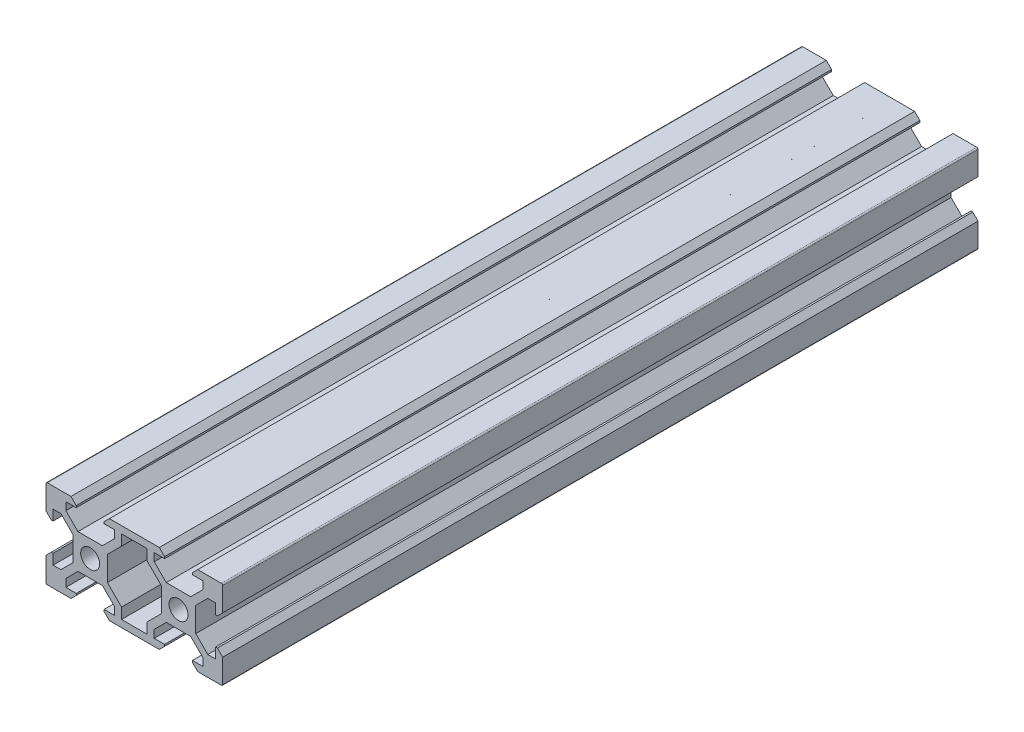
from build123d import *
from build123d.topology import SkipClean

# Parameters (mm, degrees)
SKETCH1_R           = 2.15
BOSS_EXTRUDE1_DEPTH = 41
BOSS_EXTRUDE2_START = 130
SKETCH2_R           = 2.15
BOSS_EXTRUDE2_DEPTH = 130


with BuildPart() as part:
    # Sketch1 → Boss-Extrude1 (new body)
    with BuildSketch(Plane.XY):
        with BuildLine():
            Line((131.660849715, 175.88977764), (129.310849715, 175.88977764))
            Line((129.310849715, 175.88977764), (129.310849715, 175.48977764))
            Line((129.310849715, 175.48977764), (130.510849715, 174.28977764))
            Line((130.510849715, 174.28977764), (141.810849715, 174.28977764))
            Line((141.810849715, 174.28977764), (143.010849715, 175.48977764))
            Line((143.010849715, 175.48977764), (143.010849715, 175.88977764))
            Line((143.010849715, 175.88977764), (140.660849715, 175.88977764))
            Line((140.660849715, 175.88977764), (140.660849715, 177.657206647))
            Line((140.660849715, 177.657206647), (143.393420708, 180.38977764))
            Line((143.393420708, 180.38977764), (148.928278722, 180.38977764))
            Line((148.928278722, 180.38977764), (151.660849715, 177.657206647))
            Line((151.660849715, 177.657206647), (151.660849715, 175.88977764))
            Line((151.660849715, 175.88977764), (149.310849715, 175.88977764))
            Line((149.310849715, 175.88977764), (149.310849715, 175.48977764))
            Line((149.310849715, 175.48977764), (150.510849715, 174.28977764))
            Line((150.510849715, 174.28977764), (155.860849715, 174.28977764))
            ThreePointArc((155.860849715, 174.28977764), (156.072981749, 174.377645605), (156.160849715, 174.58977764))
            Line((156.160849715, 174.58977764), (156.160849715, 179.93977764))
            Line((156.160849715, 179.93977764), (154.960849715, 181.13977764))
            Line((154.960849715, 181.13977764), (154.560849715, 181.13977764))
            Line((154.560849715, 181.13977764), (154.560849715, 178.78977764))
            Line((154.560849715, 178.78977764), (152.79324963, 178.78977764))
            Line((152.79324963, 178.78977764), (150.059649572, 181.522729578))
            Line((150.059649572, 181.522729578), (150.059649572, 187.056006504))
            Line((150.059649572, 187.056006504), (152.793420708, 189.78977764))
            Line((152.793420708, 189.78977764), (154.560849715, 189.78977764))
            Line((154.560849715, 189.78977764), (154.560849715, 187.43977764))
            Line((154.560849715, 187.43977764), (154.960849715, 187.43977764))
            Line((154.960849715, 187.43977764), (156.160849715, 188.63977764))
            Line((156.160849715, 188.63977764), (156.160849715, 193.98977764))
            ThreePointArc((156.160849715, 193.98977764), (156.072981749, 194.201909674), (155.860849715, 194.28977764))
            Line((155.860849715, 194.28977764), (150.510849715, 194.28977764))
            Line((150.510849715, 194.28977764), (149.310849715, 193.08977764))
            Line((149.310849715, 193.08977764), (149.310849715, 192.68977764))
            Line((149.310849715, 192.68977764), (151.660849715, 192.68977764))
            Line((151.660849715, 192.68977764), (151.660849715, 190.928228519))
            Line((151.660849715, 190.928228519), (148.924110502, 188.18977764))
            Line((148.924110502, 188.18977764), (143.391020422, 188.18977764))
            Line((143.391020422, 188.18977764), (140.660849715, 190.919301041))
            Line((140.660849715, 190.919301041), (140.660849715, 192.68977764))
            Line((140.660849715, 192.68977764), (143.010849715, 192.68977764))
            Line((143.010849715, 192.68977764), (143.010849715, 193.08977764))
            Line((143.010849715, 193.08977764), (141.810849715, 194.28977764))
            Line((141.810849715, 194.28977764), (130.510849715, 194.28977764))
            Line((130.510849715, 194.28977764), (129.310849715, 193.08977764))
            Line((129.310849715, 193.08977764), (129.310849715, 192.68977764))
            Line((129.310849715, 192.68977764), (131.660849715, 192.68977764))
            Line((131.660849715, 192.68977764), (131.660849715, 190.922348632))
            Line((131.660849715, 190.922348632), (128.928461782, 188.1899607))
            Line((128.928461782, 188.1899607), (123.393237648, 188.1899607))
            Line((123.393237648, 188.1899607), (120.660849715, 190.922348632))
            Line((120.660849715, 190.922348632), (120.660849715, 192.68977764))
            Line((120.660849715, 192.68977764), (123.010849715, 192.68977764))
            Line((123.010849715, 192.68977764), (123.010849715, 193.08977764))
            Line((123.010849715, 193.08977764), (121.810849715, 194.28977764))
            Line((121.810849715, 194.28977764), (116.46204982, 194.28977764))
            ThreePointArc((116.46204982, 194.28977764), (116.249917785, 194.201909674), (116.16204982, 193.98977764))
            Line((116.16204982, 193.98977764), (116.16204982, 188.63977764))
            Line((116.16204982, 188.63977764), (117.36204982, 187.43977764))
            Line((117.36204982, 187.43977764), (117.76204982, 187.43977764))
            Line((117.76204982, 187.43977764), (117.76204982, 189.78977764))
            Line((117.76204982, 189.78977764), (119.531155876, 189.78977764))
            Line((119.531155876, 189.78977764), (122.260849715, 187.060373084))
            Line((122.260849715, 187.060373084), (122.260849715, 181.522348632))
            Line((122.260849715, 181.522348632), (119.528278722, 178.78977764))
            Line((119.528278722, 178.78977764), (117.76204982, 178.78977764))
            Line((117.76204982, 178.78977764), (117.76204982, 181.13977764))
            Line((117.76204982, 181.13977764), (117.36204982, 181.13977764))
            Line((117.36204982, 181.13977764), (116.16204982, 179.93977764))
            Line((116.16204982, 179.93977764), (116.16204982, 174.58977764))
            ThreePointArc((116.16204982, 174.58977764), (116.249917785, 174.377645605), (116.46204982, 174.28977764))
            Line((116.46204982, 174.28977764), (121.810849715, 174.28977764))
            Line((121.810849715, 174.28977764), (123.010849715, 175.48977764))
            Line((123.010849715, 175.48977764), (123.010849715, 175.88977764))
            Line((123.010849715, 175.88977764), (120.660849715, 175.88977764))
            Line((120.660849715, 175.88977764), (120.660849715, 177.657854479))
            Line((120.660849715, 177.657854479), (123.392430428, 180.3899607))
            Line((123.392430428, 180.3899607), (128.93196908, 180.3899607))
            Line((128.93196908, 180.3899607), (131.660849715, 177.661369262))
            Line((131.660849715, 177.661369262), (131.660849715, 175.88977764))
        make_face()
        with Locations((146.160849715, 184.28977764)):
            Circle(SKETCH1_R, mode=Mode.SUBTRACT)
        with Locations((126.164133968, 184.2899607)):
            Circle(SKETCH1_R, mode=Mode.SUBTRACT)
        Polygon((142.259649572, 181.52114849), (142.259649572, 187.05840679), (139.060849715, 190.257206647), (139.060849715, 192.68977764), (133.260849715, 192.68977764), (133.260849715, 190.260278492), (130.060849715, 187.05966287), (130.060849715, 181.522348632), (133.260849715, 178.322348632), (133.260849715, 175.88977764), (139.060849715, 175.88977764), (139.060849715, 178.322348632), align=None, mode=Mode.SUBTRACT)
    extrude(amount=BOSS_EXTRUDE1_DEPTH)

    # Sketch2 → Boss-Extrude2 (add)
    with SkipClean():  # the faces are left unmerged after this step: merging them gives an invalid solid
        with BuildSketch(Plane(origin=(0, 0, 0), x_dir=(-1, 0, 0), z_dir=(0, 0, -1)).offset(BOSS_EXTRUDE2_START)):
            with BuildLine():
                Line((-129.310849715, 175.48977764), (-129.310849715, 175.88977764))
                Line((-129.310849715, 175.88977764), (-131.660849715, 175.88977764))
                Line((-131.660849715, 175.88977764), (-131.660849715, 177.661369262))
                Line((-131.660849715, 177.661369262), (-128.93196908, 180.3899607))
                Line((-128.93196908, 180.3899607), (-123.392430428, 180.3899607))
                Line((-123.392430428, 180.3899607), (-120.660849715, 177.657854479))
                Line((-120.660849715, 177.657854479), (-120.660849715, 175.88977764))
                Line((-120.660849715, 175.88977764), (-123.010849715, 175.88977764))
                Line((-123.010849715, 175.88977764), (-123.010849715, 175.48977764))
                Line((-123.010849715, 175.48977764), (-121.810849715, 174.28977764))
                Line((-121.810849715, 174.28977764), (-116.46204982, 174.28977764))
                ThreePointArc((-116.46204982, 174.28977764), (-116.249917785, 174.377645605), (-116.16204982, 174.58977764))
                Line((-116.16204982, 174.58977764), (-116.16204982, 179.93977764))
                Line((-116.16204982, 179.93977764), (-117.36204982, 181.13977764))
                Line((-117.36204982, 181.13977764), (-117.76204982, 181.13977764))
                Line((-117.76204982, 181.13977764), (-117.76204982, 178.78977764))
                Line((-117.76204982, 178.78977764), (-119.528278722, 178.78977764))
                Line((-119.528278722, 178.78977764), (-122.260849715, 181.522348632))
                Line((-122.260849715, 181.522348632), (-122.260849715, 187.060373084))
                Line((-122.260849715, 187.060373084), (-119.531155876, 189.78977764))
                Line((-119.531155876, 189.78977764), (-117.76204982, 189.78977764))
                Line((-117.76204982, 189.78977764), (-117.76204982, 187.43977764))
                Line((-117.76204982, 187.43977764), (-117.36204982, 187.43977764))
                Line((-117.36204982, 187.43977764), (-116.16204982, 188.63977764))
                Line((-116.16204982, 188.63977764), (-116.16204982, 193.98977764))
                ThreePointArc((-116.16204982, 193.98977764), (-116.249917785, 194.201909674), (-116.46204982, 194.28977764))
                Line((-116.46204982, 194.28977764), (-121.810849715, 194.28977764))
                Line((-121.810849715, 194.28977764), (-123.010849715, 193.08977764))
                Line((-123.010849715, 193.08977764), (-123.010849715, 192.68977764))
                Line((-123.010849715, 192.68977764), (-120.660849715, 192.68977764))
                Line((-120.660849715, 192.68977764), (-120.660849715, 190.922348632))
                Line((-120.660849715, 190.922348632), (-123.393237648, 188.1899607))
                Line((-123.393237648, 188.1899607), (-128.928461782, 188.1899607))
                Line((-128.928461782, 188.1899607), (-131.660849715, 190.922348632))
                Line((-131.660849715, 190.922348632), (-131.660849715, 192.68977764))
                Line((-131.660849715, 192.68977764), (-129.310849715, 192.68977764))
                Line((-129.310849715, 192.68977764), (-129.310849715, 193.08977764))
                Line((-129.310849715, 193.08977764), (-130.510849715, 194.28977764))
                Line((-130.510849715, 194.28977764), (-141.810849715, 194.28977764))
                Line((-141.810849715, 194.28977764), (-143.010849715, 193.08977764))
                Line((-143.010849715, 193.08977764), (-143.010849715, 192.68977764))
                Line((-143.010849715, 192.68977764), (-140.660849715, 192.68977764))
                Line((-140.660849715, 192.68977764), (-140.660849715, 190.919301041))
                Line((-140.660849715, 190.919301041), (-143.391020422, 188.18977764))
                Line((-143.391020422, 188.18977764), (-148.924110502, 188.18977764))
                Line((-148.924110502, 188.18977764), (-151.660849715, 190.928228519))
                Line((-151.660849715, 190.928228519), (-151.660849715, 192.68977764))
                Line((-151.660849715, 192.68977764), (-149.310849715, 192.68977764))
                Line((-149.310849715, 192.68977764), (-149.310849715, 193.08977764))
                Line((-149.310849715, 193.08977764), (-150.510849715, 194.28977764))
                Line((-150.510849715, 194.28977764), (-155.860849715, 194.28977764))
                ThreePointArc((-155.860849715, 194.28977764), (-156.072981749, 194.201909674), (-156.160849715, 193.98977764))
                Line((-156.160849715, 193.98977764), (-156.160849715, 188.63977764))
                Line((-156.160849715, 188.63977764), (-154.960849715, 187.43977764))
                Line((-154.960849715, 187.43977764), (-154.560849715, 187.43977764))
                Line((-154.560849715, 187.43977764), (-154.560849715, 189.78977764))
                Line((-154.560849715, 189.78977764), (-152.793420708, 189.78977764))
                Line((-152.793420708, 189.78977764), (-150.059649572, 187.056006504))
                Line((-150.059649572, 187.056006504), (-150.059649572, 181.522729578))
                Line((-150.059649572, 181.522729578), (-152.79324963, 178.78977764))
                Line((-152.79324963, 178.78977764), (-154.560849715, 178.78977764))
                Line((-154.560849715, 178.78977764), (-154.560849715, 181.13977764))
                Line((-154.560849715, 181.13977764), (-154.960849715, 181.13977764))
                Line((-154.960849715, 181.13977764), (-156.160849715, 179.93977764))
                Line((-156.160849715, 179.93977764), (-156.160849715, 174.58977764))
                ThreePointArc((-156.160849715, 174.58977764), (-156.072981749, 174.377645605), (-155.860849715, 174.28977764))
                Line((-155.860849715, 174.28977764), (-150.510849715, 174.28977764))
                Line((-150.510849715, 174.28977764), (-149.310849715, 175.48977764))
                Line((-149.310849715, 175.48977764), (-149.310849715, 175.88977764))
                Line((-149.310849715, 175.88977764), (-151.660849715, 175.88977764))
                Line((-151.660849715, 175.88977764), (-151.660849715, 177.657206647))
                Line((-151.660849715, 177.657206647), (-148.928278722, 180.38977764))
                Line((-148.928278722, 180.38977764), (-143.393420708, 180.38977764))
                Line((-143.393420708, 180.38977764), (-140.660849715, 177.657206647))
                Line((-140.660849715, 177.657206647), (-140.660849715, 175.88977764))
                Line((-140.660849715, 175.88977764), (-143.010849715, 175.88977764))
                Line((-143.010849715, 175.88977764), (-143.010849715, 175.48977764))
                Line((-143.010849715, 175.48977764), (-141.810849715, 174.28977764))
                Line((-141.810849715, 174.28977764), (-130.510849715, 174.28977764))
                Line((-130.510849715, 174.28977764), (-129.310849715, 175.48977764))
            make_face()
            with Locations((-126.164133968, 184.2899607)):
                Circle(SKETCH2_R, mode=Mode.SUBTRACT)
            with Locations((-146.160849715, 184.28977764)):
                Circle(SKETCH2_R, mode=Mode.SUBTRACT)
            Polygon((-133.260849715, 192.68977764), (-133.260849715, 190.260278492), (-130.060849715, 187.05966287), (-130.060849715, 181.522348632), (-133.260849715, 178.322348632), (-133.260849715, 175.88977764), (-139.060849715, 175.88977764), (-139.060849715, 178.322348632), (-142.259649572, 181.52114849), (-142.259649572, 187.05840679), (-139.060849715, 190.257206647), (-139.060849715, 192.68977764), align=None, mode=Mode.SUBTRACT)
        extrude(amount=-BOSS_EXTRUDE2_DEPTH)


solid = part.part
